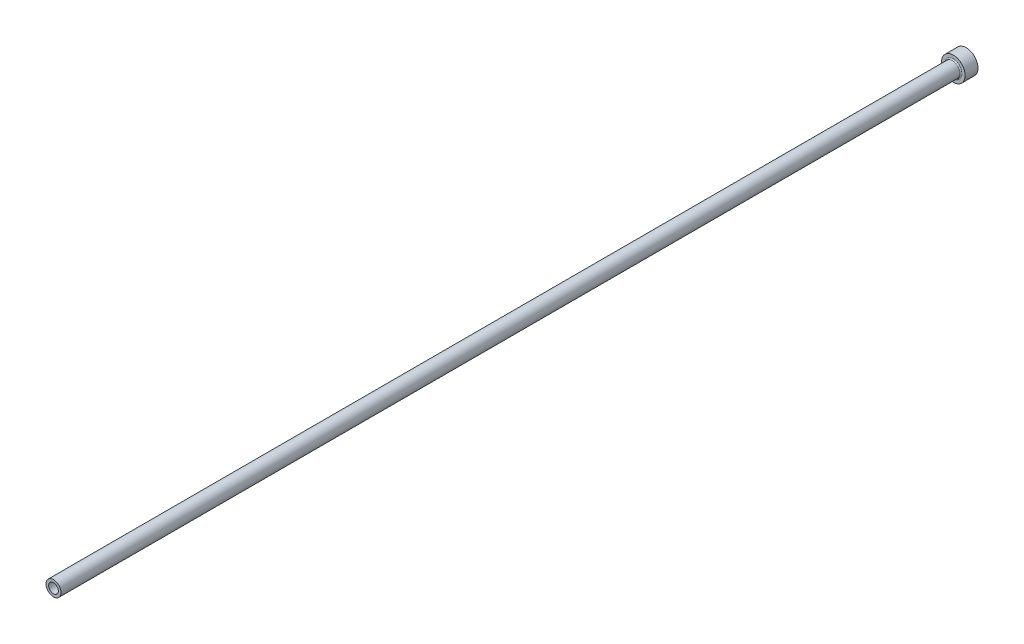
from build123d import *

# Parameters (mm, degrees)
HEAD_FILLET_R          = 0.5
ID_RELIEF_CHAMFER_SIZE = 0.5


with BuildPart() as part:
    # OD FV → Base Revolve (revolve)
    with BuildSketch(Plane(origin=(0, 0, 0), x_dir=(1, 0, 0), z_dir=(0, 1, 0))):
        Polygon((0, -425), (3.5, -425), (3.5, -6), (5.5, -6), (5.5, 0), (0, 0), align=None)
    revolve(axis=Axis((0, 0, 425), (0, 0, -1)))

    # ID FV → Hole (revolve, cut)
    with BuildSketch(Plane(origin=(0, 0, 0), x_dir=(1, 0, 0), z_dir=(0, 1, 0))):
        Polygon((0, -425), (2.25, -425), (2.25, -275), (2.5, -274.566987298), (2.5, 0), (0, 0), align=None)
    revolve(axis=Axis((0, 0, 425), (0, 0, -1)), mode=Mode.SUBTRACT)

    # Head Fillet
    head_fillet_edges = [part.edges().sort_by_distance(p)[0] for p in [
        (-3.5, 0, 6),
    ]]
    fillet(head_fillet_edges, radius=HEAD_FILLET_R)

    # ID Relief Chamfer
    id_relief_chamfer_edges = [part.edges().sort_by_distance(p)[0] for p in [
        (-2.5, 0, 0),
    ]]
    chamfer(id_relief_chamfer_edges, length=ID_RELIEF_CHAMFER_SIZE)


solid = part.part
